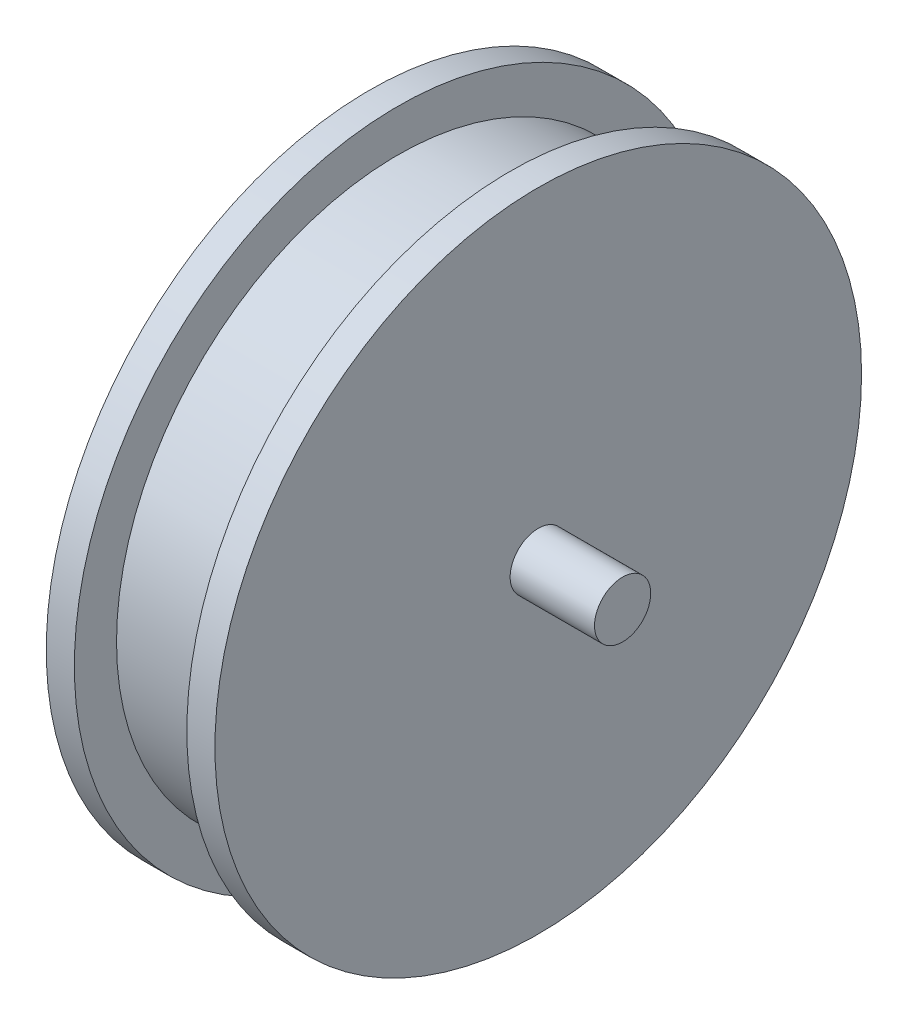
ISO-10303-21;
HEADER;
FILE_DESCRIPTION(('STEP AP214'),'2;1');
FILE_NAME('part.step','',(''),(''),'','','');
FILE_SCHEMA(('AUTOMOTIVE_DESIGN { 1 0 10303 214 1 1 1 1 }'));
ENDSEC;
DATA;
#1=APPLICATION_CONTEXT('core data for automotive mechanical design processes');
#2=APPLICATION_PROTOCOL_DEFINITION('international standard','automotive_design',2000,#1);
#3=PRODUCT_CONTEXT('',#1,'mechanical');
#4=PRODUCT('Part','Part','',(#3));
#5=PRODUCT_RELATED_PRODUCT_CATEGORY('part','',(#4));
#6=PRODUCT_DEFINITION_FORMATION('','',#4);
#7=PRODUCT_DEFINITION_CONTEXT('part definition',#1,'design');
#8=PRODUCT_DEFINITION('design','',#6,#7);
#9=PRODUCT_DEFINITION_SHAPE('','',#8);
#10=(LENGTH_UNIT() NAMED_UNIT(*) SI_UNIT(.MILLI.,.METRE.));
#11=(NAMED_UNIT(*) PLANE_ANGLE_UNIT() SI_UNIT($,.RADIAN.));
#12=(NAMED_UNIT(*) SI_UNIT($,.STERADIAN.) SOLID_ANGLE_UNIT());
#13=UNCERTAINTY_MEASURE_WITH_UNIT(LENGTH_MEASURE(1.E-05),#10,'distance_accuracy_value','');
#14=(GEOMETRIC_REPRESENTATION_CONTEXT(3) GLOBAL_UNCERTAINTY_ASSIGNED_CONTEXT((#13)) GLOBAL_UNIT_ASSIGNED_CONTEXT((#10,
#11,#12)) REPRESENTATION_CONTEXT('',''));
#15=CARTESIAN_POINT('',(0.,0.,0.));
#16=DIRECTION('',(0.,0.,1.));
#17=DIRECTION('',(1.,0.,0.));
#18=AXIS2_PLACEMENT_3D('',#15,#16,#17);
#19=CARTESIAN_POINT('',(3.,0.,0.));
#20=DIRECTION('',(-1.,0.,0.));
#21=DIRECTION('',(0.,0.,1.));
#22=AXIS2_PLACEMENT_3D('',#19,#20,#21);
#23=CYLINDRICAL_SURFACE('',#22,10.);
#24=CARTESIAN_POINT('',(2.,0.,0.));
#25=DIRECTION('',(1.,0.,0.));
#26=DIRECTION('',(0.,0.,-1.));
#27=AXIS2_PLACEMENT_3D('',#24,#25,#26);
#28=CIRCLE('',#27,10.);
#29=CARTESIAN_POINT('',(2.,0.,-10.));
#30=VERTEX_POINT('',#29);
#31=EDGE_CURVE('E38',#30,#30,#28,.T.);
#32=ORIENTED_EDGE('',*,*,#31,.F.);
#33=EDGE_LOOP('',(#32));
#34=FACE_BOUND('',#33,.T.);
#35=CARTESIAN_POINT('',(-2.,0.,0.));
#36=DIRECTION('',(-1.,0.,0.));
#37=DIRECTION('',(0.,0.,1.));
#38=AXIS2_PLACEMENT_3D('',#35,#36,#37);
#39=CIRCLE('',#38,10.);
#40=CARTESIAN_POINT('',(-2.,0.,10.));
#41=VERTEX_POINT('',#40);
#42=EDGE_CURVE('E10',#41,#41,#39,.T.);
#43=ORIENTED_EDGE('',*,*,#42,.F.);
#44=EDGE_LOOP('',(#43));
#45=FACE_BOUND('',#44,.T.);
#46=ADVANCED_FACE('F32',(#34,#45),#23,.T.);
#47=CARTESIAN_POINT('',(3.,0.,0.));
#48=DIRECTION('',(1.,0.,0.));
#49=DIRECTION('',(0.,0.,-1.));
#50=AXIS2_PLACEMENT_3D('',#47,#48,#49);
#51=PLANE('',#50);
#52=CARTESIAN_POINT('',(3.,0.,0.));
#53=DIRECTION('',(1.,0.,0.));
#54=DIRECTION('',(0.,0.,-1.));
#55=AXIS2_PLACEMENT_3D('',#52,#53,#54);
#56=CIRCLE('',#55,11.5);
#57=CARTESIAN_POINT('',(3.,0.,-11.5));
#58=VERTEX_POINT('',#57);
#59=EDGE_CURVE('E46',#58,#58,#56,.T.);
#60=ORIENTED_EDGE('',*,*,#59,.T.);
#61=EDGE_LOOP('',(#60));
#62=FACE_BOUND('',#61,.T.);
#63=CARTESIAN_POINT('',(3.,0.,0.));
#64=DIRECTION('',(1.,0.,0.));
#65=DIRECTION('',(0.,0.,-1.));
#66=AXIS2_PLACEMENT_3D('',#63,#64,#65);
#67=CIRCLE('',#66,1.);
#68=CARTESIAN_POINT('',(3.,0.,-1.));
#69=VERTEX_POINT('',#68);
#70=EDGE_CURVE('E52',#69,#69,#67,.T.);
#71=ORIENTED_EDGE('',*,*,#70,.F.);
#72=EDGE_LOOP('',(#71));
#73=FACE_BOUND('',#72,.T.);
#74=ADVANCED_FACE('F82',(#62,#73),#51,.T.);
#75=CARTESIAN_POINT('',(2.,0.,0.));
#76=DIRECTION('',(1.,0.,0.));
#77=DIRECTION('',(0.,0.,-1.));
#78=AXIS2_PLACEMENT_3D('',#75,#76,#77);
#79=CYLINDRICAL_SURFACE('',#78,11.5);
#80=CARTESIAN_POINT('',(2.,0.,0.));
#81=DIRECTION('',(1.,0.,0.));
#82=DIRECTION('',(0.,0.,-1.));
#83=AXIS2_PLACEMENT_3D('',#80,#81,#82);
#84=CIRCLE('',#83,11.5);
#85=CARTESIAN_POINT('',(2.,0.,-11.5));
#86=VERTEX_POINT('',#85);
#87=EDGE_CURVE('E42',#86,#86,#84,.T.);
#88=ORIENTED_EDGE('',*,*,#87,.T.);
#89=EDGE_LOOP('',(#88));
#90=FACE_BOUND('',#89,.T.);
#91=ORIENTED_EDGE('',*,*,#59,.F.);
#92=EDGE_LOOP('',(#91));
#93=FACE_BOUND('',#92,.T.);
#94=ADVANCED_FACE('F87',(#90,#93),#79,.T.);
#95=CARTESIAN_POINT('',(2.,0.,0.));
#96=DIRECTION('',(1.,0.,0.));
#97=DIRECTION('',(0.,0.,-1.));
#98=AXIS2_PLACEMENT_3D('',#95,#96,#97);
#99=PLANE('',#98);
#100=ORIENTED_EDGE('',*,*,#31,.T.);
#101=EDGE_LOOP('',(#100));
#102=FACE_BOUND('',#101,.T.);
#103=ORIENTED_EDGE('',*,*,#87,.F.);
#104=EDGE_LOOP('',(#103));
#105=FACE_BOUND('',#104,.T.);
#106=ADVANCED_FACE('F94',(#102,#105),#99,.F.);
#107=CARTESIAN_POINT('',(6.,0.,0.));
#108=DIRECTION('',(-1.,0.,0.));
#109=DIRECTION('',(0.,0.,1.));
#110=AXIS2_PLACEMENT_3D('',#107,#108,#109);
#111=CYLINDRICAL_SURFACE('',#110,1.);
#112=CARTESIAN_POINT('',(6.,0.,0.));
#113=DIRECTION('',(1.,0.,0.));
#114=DIRECTION('',(0.,0.,-1.));
#115=AXIS2_PLACEMENT_3D('',#112,#113,#114);
#116=CIRCLE('',#115,1.);
#117=CARTESIAN_POINT('',(6.,0.,-1.));
#118=VERTEX_POINT('',#117);
#119=EDGE_CURVE('E50',#118,#118,#116,.T.);
#120=ORIENTED_EDGE('',*,*,#119,.F.);
#121=EDGE_LOOP('',(#120));
#122=FACE_BOUND('',#121,.T.);
#123=ORIENTED_EDGE('',*,*,#70,.T.);
#124=EDGE_LOOP('',(#123));
#125=FACE_BOUND('',#124,.T.);
#126=ADVANCED_FACE('F122',(#122,#125),#111,.T.);
#127=CARTESIAN_POINT('',(6.,0.,0.));
#128=DIRECTION('',(1.,0.,0.));
#129=DIRECTION('',(0.,0.,-1.));
#130=AXIS2_PLACEMENT_3D('',#127,#128,#129);
#131=PLANE('',#130);
#132=ORIENTED_EDGE('',*,*,#119,.T.);
#133=EDGE_LOOP('',(#132));
#134=FACE_BOUND('',#133,.T.);
#135=ADVANCED_FACE('F115',(#134),#131,.T.);
#136=CARTESIAN_POINT('',(-2.,0.,0.));
#137=DIRECTION('',(-1.,0.,0.));
#138=DIRECTION('',(0.,0.,-1.));
#139=AXIS2_PLACEMENT_3D('',#136,#137,#138);
#140=PLANE('',#139);
#141=CARTESIAN_POINT('',(-2.,0.,0.));
#142=DIRECTION('',(1.,0.,0.));
#143=DIRECTION('',(0.,0.,-1.));
#144=AXIS2_PLACEMENT_3D('',#141,#142,#143);
#145=CIRCLE('',#144,11.5);
#146=CARTESIAN_POINT('',(-2.,0.,-11.5));
#147=VERTEX_POINT('',#146);
#148=EDGE_CURVE('E55',#147,#147,#145,.T.);
#149=ORIENTED_EDGE('',*,*,#148,.T.);
#150=EDGE_LOOP('',(#149));
#151=FACE_BOUND('',#150,.T.);
#152=ORIENTED_EDGE('',*,*,#42,.T.);
#153=EDGE_LOOP('',(#152));
#154=FACE_BOUND('',#153,.T.);
#155=ADVANCED_FACE('F105',(#151,#154),#140,.F.);
#156=CARTESIAN_POINT('',(-2.,0.,0.));
#157=DIRECTION('',(-1.,0.,0.));
#158=DIRECTION('',(0.,0.,1.));
#159=AXIS2_PLACEMENT_3D('',#156,#157,#158);
#160=CYLINDRICAL_SURFACE('',#159,11.5);
#161=ORIENTED_EDGE('',*,*,#148,.F.);
#162=EDGE_LOOP('',(#161));
#163=FACE_BOUND('',#162,.T.);
#164=CARTESIAN_POINT('',(-3.,0.,0.));
#165=DIRECTION('',(1.,0.,0.));
#166=DIRECTION('',(0.,0.,-1.));
#167=AXIS2_PLACEMENT_3D('',#164,#165,#166);
#168=CIRCLE('',#167,11.5);
#169=CARTESIAN_POINT('',(-3.,0.,-11.5));
#170=VERTEX_POINT('',#169);
#171=EDGE_CURVE('E58',#170,#170,#168,.T.);
#172=ORIENTED_EDGE('',*,*,#171,.T.);
#173=EDGE_LOOP('',(#172));
#174=FACE_BOUND('',#173,.T.);
#175=ADVANCED_FACE('F100',(#163,#174),#160,.T.);
#176=CARTESIAN_POINT('',(-3.,0.,0.));
#177=DIRECTION('',(1.,0.,0.));
#178=DIRECTION('',(0.,0.,-1.));
#179=AXIS2_PLACEMENT_3D('',#176,#177,#178);
#180=PLANE('',#179);
#181=CARTESIAN_POINT('',(-3.,0.,0.));
#182=DIRECTION('',(1.,0.,0.));
#183=DIRECTION('',(0.,0.,-1.));
#184=AXIS2_PLACEMENT_3D('',#181,#182,#183);
#185=CIRCLE('',#184,1.);
#186=CARTESIAN_POINT('',(-3.,0.,-1.));
#187=VERTEX_POINT('',#186);
#188=EDGE_CURVE('E64',#187,#187,#185,.T.);
#189=ORIENTED_EDGE('',*,*,#188,.T.);
#190=EDGE_LOOP('',(#189));
#191=FACE_BOUND('',#190,.T.);
#192=ORIENTED_EDGE('',*,*,#171,.F.);
#193=EDGE_LOOP('',(#192));
#194=FACE_BOUND('',#193,.T.);
#195=ADVANCED_FACE('F79',(#191,#194),#180,.F.);
#196=CARTESIAN_POINT('',(-6.,0.,0.));
#197=DIRECTION('',(1.,0.,0.));
#198=DIRECTION('',(0.,0.,-1.));
#199=AXIS2_PLACEMENT_3D('',#196,#197,#198);
#200=CYLINDRICAL_SURFACE('',#199,1.);
#201=CARTESIAN_POINT('',(-6.,0.,0.));
#202=DIRECTION('',(1.,0.,0.));
#203=DIRECTION('',(0.,0.,-1.));
#204=AXIS2_PLACEMENT_3D('',#201,#202,#203);
#205=CIRCLE('',#204,1.);
#206=CARTESIAN_POINT('',(-6.,0.,-1.));
#207=VERTEX_POINT('',#206);
#208=EDGE_CURVE('E61',#207,#207,#205,.T.);
#209=ORIENTED_EDGE('',*,*,#208,.T.);
#210=EDGE_LOOP('',(#209));
#211=FACE_BOUND('',#210,.T.);
#212=ORIENTED_EDGE('',*,*,#188,.F.);
#213=EDGE_LOOP('',(#212));
#214=FACE_BOUND('',#213,.T.);
#215=ADVANCED_FACE('F70',(#211,#214),#200,.T.);
#216=CARTESIAN_POINT('',(-6.,0.,0.));
#217=DIRECTION('',(-1.,0.,0.));
#218=DIRECTION('',(0.,0.,-1.));
#219=AXIS2_PLACEMENT_3D('',#216,#217,#218);
#220=PLANE('',#219);
#221=ORIENTED_EDGE('',*,*,#208,.F.);
#222=EDGE_LOOP('',(#221));
#223=FACE_BOUND('',#222,.T.);
#224=ADVANCED_FACE('F73',(#223),#220,.T.);
#225=CLOSED_SHELL('',(#46,#74,#94,#106,#126,#135,#155,#175,#195,#215,#224));
#226=MANIFOLD_SOLID_BREP('B2',#225);
#227=ADVANCED_BREP_SHAPE_REPRESENTATION('',(#18,#226),#14);
#228=SHAPE_DEFINITION_REPRESENTATION(#9,#227);
ENDSEC;
END-ISO-10303-21;
